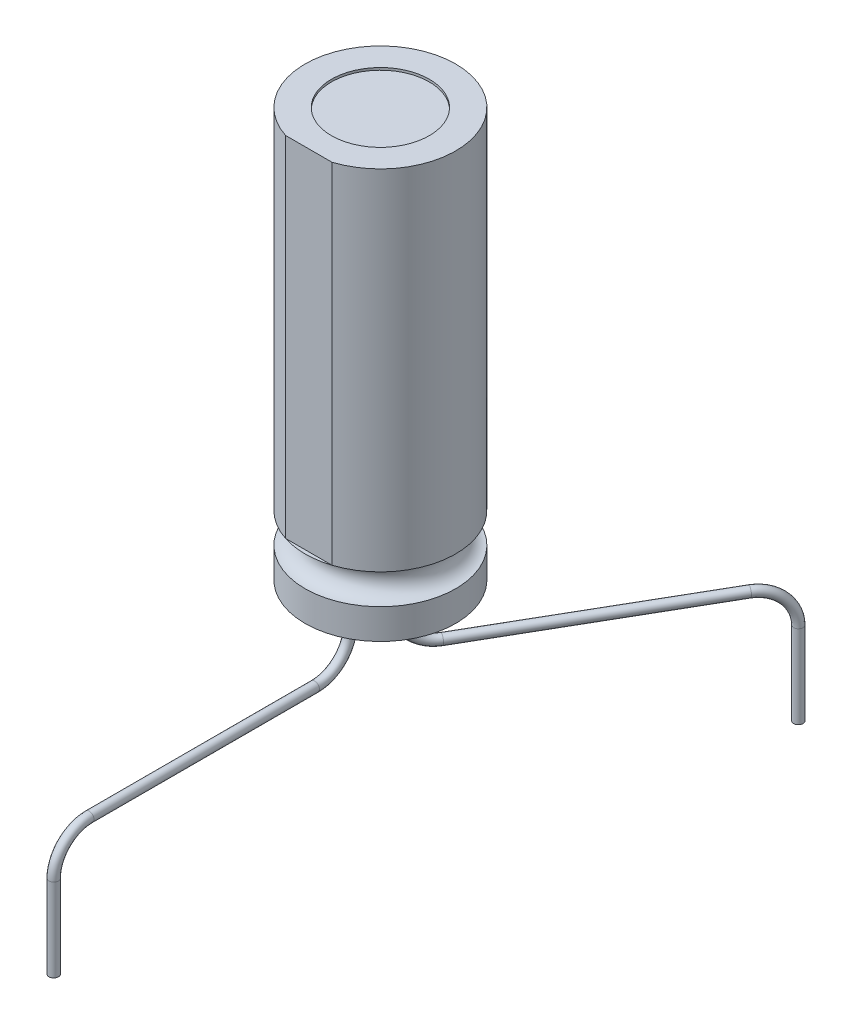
from build123d import *

# Parameters (mm, degrees)
ESQUISSE2_R             = 4.125
ENL_V_MAT_EXTRU_1_DEPTH = 0.2
ESQUISSE5_W             = 5
ESQUISSE5_H             = 29.42
ENL_V_MAT_EXTRU_4_DEPTH = 0.5
ESQUISSE3_R             = 0.4
ESQUISSE8_R             = 0.4


with BuildPart() as part:
    # Esquisse1 → R_volution1 (revolve)
    with BuildSketch(Plane.XY, mode=Mode.PRIVATE) as r_volution1_sk:
        with BuildLine():
            Line((0, 39.516423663), (6.35, 39.516423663))
            Line((6.35, 39.516423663), (6.35, 10.096423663))
            ThreePointArc((6.35, 10.096423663), (5.08, 8.826423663), (6.35, 7.556423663))
            Line((6.35, 7.556423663), (6.35, 5.016423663))
            Line((6.35, 5.016423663), (0, 5.016423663))
            Line((0, 5.016423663), (0, 39.516423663))
        make_face()
    revolve(r_volution1_sk.sketch.rotate(Axis((0, 48.401709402, 0), (0, -1, 0)), 90), axis=Axis((0, 48.401709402, 0), (0, -1, 0)))

    # Esquisse2 → Enl_v. mat.-Extru.1 (cut)
    with BuildSketch(Plane(origin=(0, 39.516423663, 0), x_dir=(-1, 0, 0), z_dir=(0, 1, 0))):
        with Locations(Location((0, 0, 0), (0, 0, 90))):
            Circle(ESQUISSE2_R)
    extrude(amount=-ENL_V_MAT_EXTRU_1_DEPTH, mode=Mode.SUBTRACT)

    # Esquisse5 → Enl_v. mat.-Extru.4 (cut)
    with BuildSketch(Plane.XY.offset(6.54)):
        with Locations((0, 24.806423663)):
            Rectangle(ESQUISSE5_W, ESQUISSE5_H)
    extrude(amount=-ENL_V_MAT_EXTRU_4_DEPTH, mode=Mode.SUBTRACT)

    # Balayage3: sweep along a path in Esquisse6
    with BuildLine(Plane(origin=(0, 0, 0), x_dir=(0, 0, -1), z_dir=(1, 0, 0))) as balayage3_path:
        Line((-2.54, 5.016423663), (-2.54, 3.016423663))
        ThreePointArc((-2.54, 3.016423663), (-3.418679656, 0.89510332), (-5.54, 0.016423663))
        Line((-5.54, 0.016423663), (-24.54, 0.016423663))
        ThreePointArc((-24.54, 0.016423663), (-26.661320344, -0.862255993), (-27.54, -2.983576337))
        Line((-27.54, -2.983576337), (-27.54, -9.983576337))
    # Esquisse3 → Balayage3 (sweep)
    with BuildSketch(Plane.XZ.offset(-5.016423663)):
        with Locations((0, 2.54)):
            Circle(ESQUISSE3_R)
    sweep(path=balayage3_path.line)

    # Balayage4: sweep along a path in Esquisse9
    with BuildLine(Plane(origin=(0, 0, 0), x_dir=(0.4999999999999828, 0, -0.8660254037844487), z_dir=(0.8660254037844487, 0, 0.4999999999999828))) as balayage4_path:
        Line((0.789955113, 5.016423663), (0.789955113, 3.016423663))
        ThreePointArc((0.789955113, 3.016423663), (1.668634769, 0.89510332), (3.789955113, 0.016423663))
        Line((3.789955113, 0.016423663), (22.789955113, 0.016423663))
        ThreePointArc((22.789955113, 0.016423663), (24.911275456, -0.862255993), (25.789955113, -2.983576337))
        Line((25.789955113, -2.983576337), (25.789955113, -9.983576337))
    # Esquisse8 → Balayage4 (sweep)
    with BuildSketch(Plane.XZ.offset(-5.016423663)):
        with Locations((0.394977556, -0.684121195)):
            Circle(ESQUISSE8_R)
    sweep(path=balayage4_path.line)


solid = part.part
